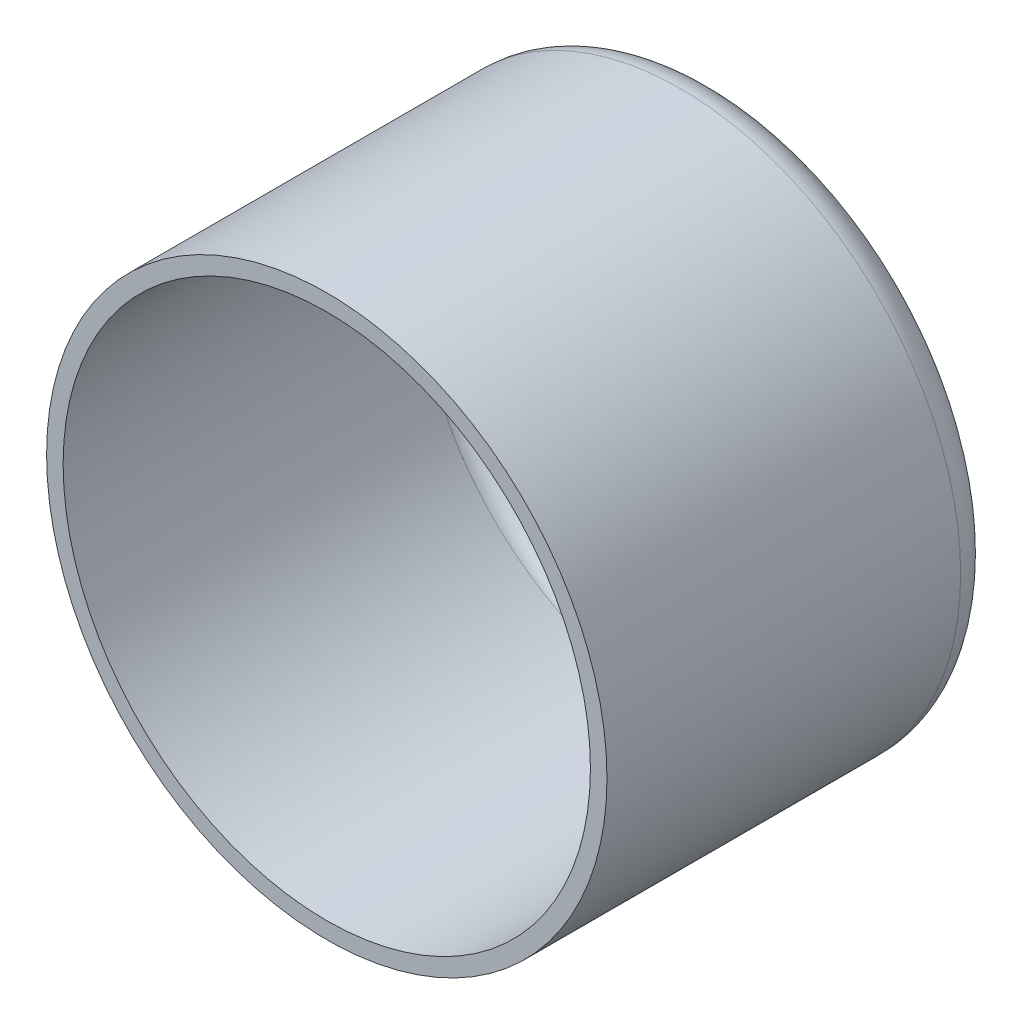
from build123d import *


with BuildPart() as part:
    # Sketch1 → Revolve1 (revolve)
    with BuildSketch(Plane(origin=(0, 0, 0), x_dir=(0, 0, -1), z_dir=(1, 0, 0)), mode=Mode.PRIVATE) as revolve1_sk:
        with BuildLine():
            Line((-15.24, 21.9329), (-15.24, 20.6375))
            Line((-15.24, 20.6375), (12.446, 20.6375))
            ThreePointArc((12.446, 20.6375), (13.505670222, 20.198570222), (13.9446, 19.1389))
            Line((13.9446, 19.1389), (13.9446, 0))
            Line((13.9446, 0), (15.24, 0))
            Line((15.24, 0), (15.24, 19.1389))
            ThreePointArc((15.24, 19.1389), (14.421656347, 21.114556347), (12.446, 21.9329))
            Line((12.446, 21.9329), (-15.24, 21.9329))
        make_face()
    revolve(revolve1_sk.sketch.rotate(Axis((0, 0, 15.24), (0, 0, -1)), 90), axis=Axis((0, 0, 15.24), (0, 0, -1)))


solid = part.part
